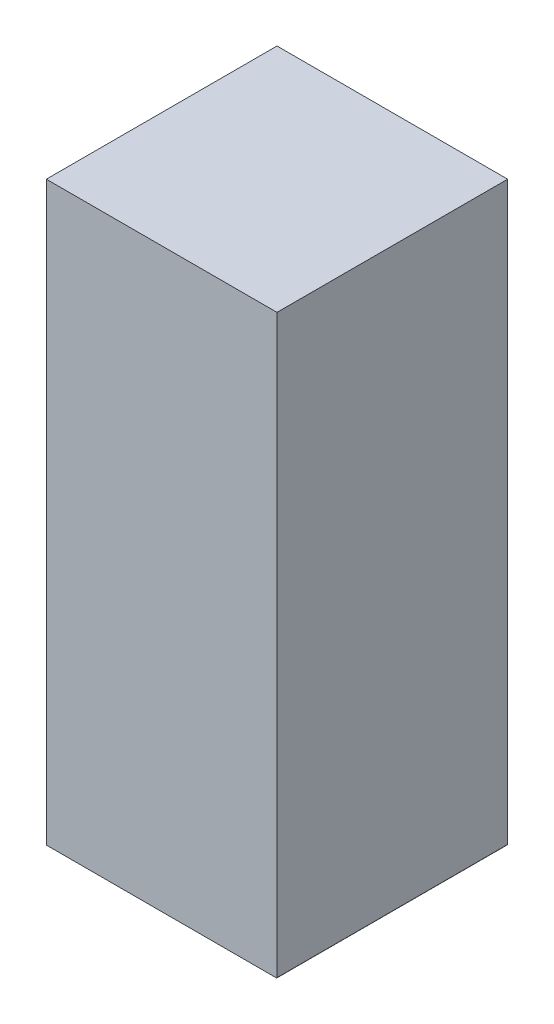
ISO-10303-21;
HEADER;
FILE_DESCRIPTION(('STEP AP214'),'2;1');
FILE_NAME('part.step','',(''),(''),'','','');
FILE_SCHEMA(('AUTOMOTIVE_DESIGN { 1 0 10303 214 1 1 1 1 }'));
ENDSEC;
DATA;
#1=APPLICATION_CONTEXT('core data for automotive mechanical design processes');
#2=APPLICATION_PROTOCOL_DEFINITION('international standard','automotive_design',2000,#1);
#3=PRODUCT_CONTEXT('',#1,'mechanical');
#4=PRODUCT('Part','Part','',(#3));
#5=PRODUCT_RELATED_PRODUCT_CATEGORY('part','',(#4));
#6=PRODUCT_DEFINITION_FORMATION('','',#4);
#7=PRODUCT_DEFINITION_CONTEXT('part definition',#1,'design');
#8=PRODUCT_DEFINITION('design','',#6,#7);
#9=PRODUCT_DEFINITION_SHAPE('','',#8);
#10=(LENGTH_UNIT() NAMED_UNIT(*) SI_UNIT(.MILLI.,.METRE.));
#11=(NAMED_UNIT(*) PLANE_ANGLE_UNIT() SI_UNIT($,.RADIAN.));
#12=(NAMED_UNIT(*) SI_UNIT($,.STERADIAN.) SOLID_ANGLE_UNIT());
#13=UNCERTAINTY_MEASURE_WITH_UNIT(LENGTH_MEASURE(1.E-05),#10,'distance_accuracy_value','');
#14=(GEOMETRIC_REPRESENTATION_CONTEXT(3) GLOBAL_UNCERTAINTY_ASSIGNED_CONTEXT((#13)) GLOBAL_UNIT_ASSIGNED_CONTEXT((#10,
#11,#12)) REPRESENTATION_CONTEXT('',''));
#15=CARTESIAN_POINT('',(0.,0.,0.));
#16=DIRECTION('',(0.,0.,1.));
#17=DIRECTION('',(1.,0.,0.));
#18=AXIS2_PLACEMENT_3D('',#15,#16,#17);
#19=CARTESIAN_POINT('',(-400.,2000.,400.));
#20=DIRECTION('',(1.,0.,0.));
#21=DIRECTION('',(0.,0.,-1.));
#22=AXIS2_PLACEMENT_3D('',#19,#20,#21);
#23=PLANE('',#22);
#24=DIRECTION('',(0.,0.,1.));
#25=VECTOR('',#24,1.);
#26=CARTESIAN_POINT('',(-400.,0.,400.));
#27=LINE('',#26,#25);
#28=CARTESIAN_POINT('',(-400.,0.,-400.));
#29=VERTEX_POINT('',#28);
#30=CARTESIAN_POINT('',(-400.,0.,400.));
#31=VERTEX_POINT('',#30);
#32=EDGE_CURVE('E103',#29,#31,#27,.T.);
#33=ORIENTED_EDGE('',*,*,#32,.T.);
#34=DIRECTION('',(0.,-1.,0.));
#35=VECTOR('',#34,1.);
#36=CARTESIAN_POINT('',(-400.,2000.,400.));
#37=LINE('',#36,#35);
#38=CARTESIAN_POINT('',(-400.,2000.,400.));
#39=VERTEX_POINT('',#38);
#40=EDGE_CURVE('E84',#39,#31,#37,.T.);
#41=ORIENTED_EDGE('',*,*,#40,.F.);
#42=DIRECTION('',(0.,0.,1.));
#43=VECTOR('',#42,1.);
#44=CARTESIAN_POINT('',(-400.,2000.,400.));
#45=LINE('',#44,#43);
#46=CARTESIAN_POINT('',(-400.,2000.,-400.));
#47=VERTEX_POINT('',#46);
#48=EDGE_CURVE('E91',#47,#39,#45,.T.);
#49=ORIENTED_EDGE('',*,*,#48,.F.);
#50=DIRECTION('',(0.,-1.,0.));
#51=VECTOR('',#50,1.);
#52=CARTESIAN_POINT('',(-400.,2000.,-400.));
#53=LINE('',#52,#51);
#54=EDGE_CURVE('E113',#47,#29,#53,.T.);
#55=ORIENTED_EDGE('',*,*,#54,.T.);
#56=EDGE_LOOP('',(#33,#41,#49,#55));
#57=FACE_BOUND('',#56,.T.);
#58=ADVANCED_FACE('F35',(#57),#23,.F.);
#59=CARTESIAN_POINT('',(400.,2000.,400.));
#60=DIRECTION('',(0.,0.,-1.));
#61=DIRECTION('',(-1.,0.,0.));
#62=AXIS2_PLACEMENT_3D('',#59,#60,#61);
#63=PLANE('',#62);
#64=DIRECTION('',(1.,0.,0.));
#65=VECTOR('',#64,1.);
#66=CARTESIAN_POINT('',(400.,0.,400.));
#67=LINE('',#66,#65);
#68=CARTESIAN_POINT('',(398.,0.,400.));
#69=VERTEX_POINT('',#68);
#70=EDGE_CURVE('E116',#31,#69,#67,.T.);
#71=ORIENTED_EDGE('',*,*,#70,.T.);
#72=CARTESIAN_POINT('',(398.,2.,400.));
#73=DIRECTION('',(0.,0.,-1.));
#74=DIRECTION('',(-1.,0.,0.));
#75=AXIS2_PLACEMENT_3D('',#72,#73,#74);
#76=CIRCLE('',#75,2.);
#77=CARTESIAN_POINT('',(400.,2.,400.));
#78=VERTEX_POINT('',#77);
#79=EDGE_CURVE('E11',#69,#78,#76,.F.);
#80=ORIENTED_EDGE('',*,*,#79,.T.);
#81=DIRECTION('',(0.,-1.,0.));
#82=VECTOR('',#81,1.);
#83=CARTESIAN_POINT('',(400.,2000.,400.));
#84=LINE('',#83,#82);
#85=CARTESIAN_POINT('',(400.,2000.,400.));
#86=VERTEX_POINT('',#85);
#87=EDGE_CURVE('E87',#86,#78,#84,.T.);
#88=ORIENTED_EDGE('',*,*,#87,.F.);
#89=DIRECTION('',(1.,0.,0.));
#90=VECTOR('',#89,1.);
#91=CARTESIAN_POINT('',(400.,2000.,400.));
#92=LINE('',#91,#90);
#93=EDGE_CURVE('E80',#39,#86,#92,.T.);
#94=ORIENTED_EDGE('',*,*,#93,.F.);
#95=ORIENTED_EDGE('',*,*,#40,.T.);
#96=EDGE_LOOP('',(#71,#80,#88,#94,#95));
#97=FACE_BOUND('',#96,.T.);
#98=ADVANCED_FACE('F82',(#97),#63,.F.);
#99=CARTESIAN_POINT('',(400.,2000.,400.));
#100=DIRECTION('',(-1.,0.,0.));
#101=DIRECTION('',(0.,0.,1.));
#102=AXIS2_PLACEMENT_3D('',#99,#100,#101);
#103=PLANE('',#102);
#104=ORIENTED_EDGE('',*,*,#87,.T.);
#105=DIRECTION('',(0.,0.,-1.));
#106=VECTOR('',#105,1.);
#107=CARTESIAN_POINT('',(400.,2.,400.));
#108=LINE('',#107,#106);
#109=CARTESIAN_POINT('',(400.,2.,-400.));
#110=VERTEX_POINT('',#109);
#111=EDGE_CURVE('E104',#78,#110,#108,.T.);
#112=ORIENTED_EDGE('',*,*,#111,.T.);
#113=DIRECTION('',(0.,-1.,0.));
#114=VECTOR('',#113,1.);
#115=CARTESIAN_POINT('',(400.,2000.,-400.));
#116=LINE('',#115,#114);
#117=CARTESIAN_POINT('',(400.,2000.,-400.));
#118=VERTEX_POINT('',#117);
#119=EDGE_CURVE('E108',#118,#110,#116,.T.);
#120=ORIENTED_EDGE('',*,*,#119,.F.);
#121=DIRECTION('',(0.,0.,-1.));
#122=VECTOR('',#121,1.);
#123=CARTESIAN_POINT('',(400.,2000.,400.));
#124=LINE('',#123,#122);
#125=EDGE_CURVE('E90',#86,#118,#124,.T.);
#126=ORIENTED_EDGE('',*,*,#125,.F.);
#127=EDGE_LOOP('',(#104,#112,#120,#126));
#128=FACE_BOUND('',#127,.T.);
#129=ADVANCED_FACE('F122',(#128),#103,.F.);
#130=CARTESIAN_POINT('',(400.,2000.,-400.));
#131=DIRECTION('',(0.,0.,1.));
#132=DIRECTION('',(1.,0.,0.));
#133=AXIS2_PLACEMENT_3D('',#130,#131,#132);
#134=PLANE('',#133);
#135=ORIENTED_EDGE('',*,*,#119,.T.);
#136=CARTESIAN_POINT('',(398.,2.,-400.));
#137=DIRECTION('',(0.,0.,1.));
#138=DIRECTION('',(1.,0.,0.));
#139=AXIS2_PLACEMENT_3D('',#136,#137,#138);
#140=CIRCLE('',#139,2.);
#141=CARTESIAN_POINT('',(398.,0.,-400.));
#142=VERTEX_POINT('',#141);
#143=EDGE_CURVE('E57',#110,#142,#140,.F.);
#144=ORIENTED_EDGE('',*,*,#143,.T.);
#145=DIRECTION('',(-1.,0.,0.));
#146=VECTOR('',#145,1.);
#147=CARTESIAN_POINT('',(400.,0.,-400.));
#148=LINE('',#147,#146);
#149=EDGE_CURVE('E100',#142,#29,#148,.T.);
#150=ORIENTED_EDGE('',*,*,#149,.T.);
#151=ORIENTED_EDGE('',*,*,#54,.F.);
#152=DIRECTION('',(-1.,0.,0.));
#153=VECTOR('',#152,1.);
#154=CARTESIAN_POINT('',(400.,2000.,-400.));
#155=LINE('',#154,#153);
#156=EDGE_CURVE('E96',#118,#47,#155,.T.);
#157=ORIENTED_EDGE('',*,*,#156,.F.);
#158=EDGE_LOOP('',(#135,#144,#150,#151,#157));
#159=FACE_BOUND('',#158,.T.);
#160=ADVANCED_FACE('F124',(#159),#134,.F.);
#161=CARTESIAN_POINT('',(0.,2000.,0.));
#162=DIRECTION('',(0.,1.,0.));
#163=DIRECTION('',(0.,0.,1.));
#164=AXIS2_PLACEMENT_3D('',#161,#162,#163);
#165=PLANE('',#164);
#166=ORIENTED_EDGE('',*,*,#48,.T.);
#167=ORIENTED_EDGE('',*,*,#93,.T.);
#168=ORIENTED_EDGE('',*,*,#125,.T.);
#169=ORIENTED_EDGE('',*,*,#156,.T.);
#170=EDGE_LOOP('',(#166,#167,#168,#169));
#171=FACE_BOUND('',#170,.T.);
#172=ADVANCED_FACE('F94',(#171),#165,.T.);
#173=CARTESIAN_POINT('',(0.,0.,0.));
#174=DIRECTION('',(0.,1.,0.));
#175=DIRECTION('',(0.,0.,1.));
#176=AXIS2_PLACEMENT_3D('',#173,#174,#175);
#177=PLANE('',#176);
#178=ORIENTED_EDGE('',*,*,#149,.F.);
#179=DIRECTION('',(0.,0.,-1.));
#180=VECTOR('',#179,1.);
#181=CARTESIAN_POINT('',(398.,0.,0.));
#182=LINE('',#181,#180);
#183=EDGE_CURVE('E43',#142,#69,#182,.F.);
#184=ORIENTED_EDGE('',*,*,#183,.T.);
#185=ORIENTED_EDGE('',*,*,#70,.F.);
#186=ORIENTED_EDGE('',*,*,#32,.F.);
#187=EDGE_LOOP('',(#178,#184,#185,#186));
#188=FACE_BOUND('',#187,.T.);
#189=ADVANCED_FACE('F125',(#188),#177,.F.);
#190=CARTESIAN_POINT('',(398.,2.,400.));
#191=DIRECTION('',(0.,0.,-1.));
#192=DIRECTION('',(-1.,0.,0.));
#193=AXIS2_PLACEMENT_3D('',#190,#191,#192);
#194=CYLINDRICAL_SURFACE('',#193,2.);
#195=ORIENTED_EDGE('',*,*,#79,.F.);
#196=ORIENTED_EDGE('',*,*,#183,.F.);
#197=ORIENTED_EDGE('',*,*,#143,.F.);
#198=ORIENTED_EDGE('',*,*,#111,.F.);
#199=EDGE_LOOP('',(#195,#196,#197,#198));
#200=FACE_BOUND('',#199,.T.);
#201=ADVANCED_FACE('F37',(#200),#194,.T.);
#202=CLOSED_SHELL('',(#58,#98,#129,#160,#172,#189,#201));
#203=MANIFOLD_SOLID_BREP('B2',#202);
#204=ADVANCED_BREP_SHAPE_REPRESENTATION('',(#18,#203),#14);
#205=SHAPE_DEFINITION_REPRESENTATION(#9,#204);
ENDSEC;
END-ISO-10303-21;
